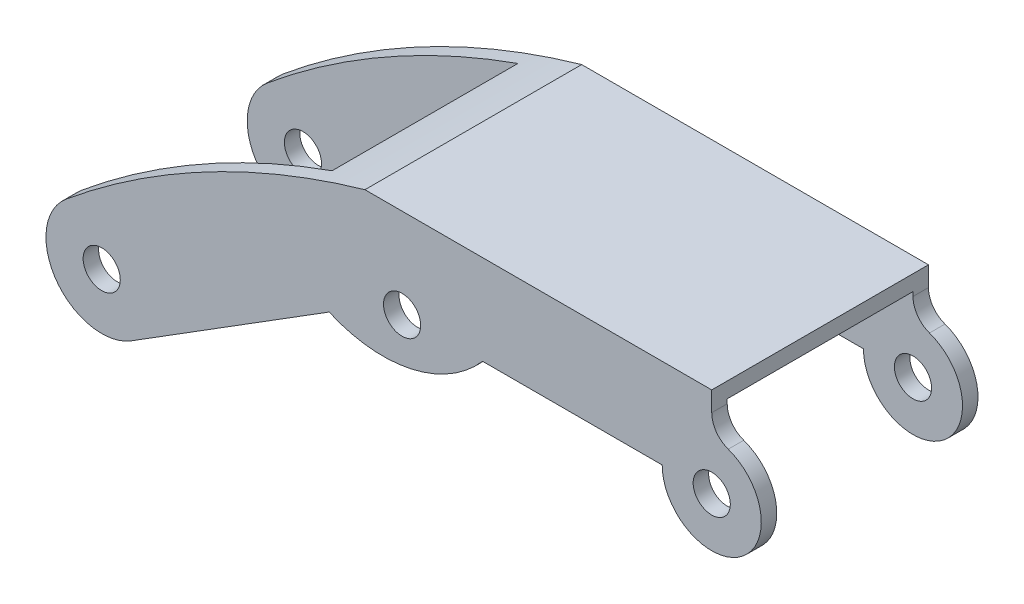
ISO-10303-21;
HEADER;
FILE_DESCRIPTION(('STEP AP214'),'2;1');
FILE_NAME('part.step','',(''),(''),'','','');
FILE_SCHEMA(('AUTOMOTIVE_DESIGN { 1 0 10303 214 1 1 1 1 }'));
ENDSEC;
DATA;
#1=APPLICATION_CONTEXT('core data for automotive mechanical design processes');
#2=APPLICATION_PROTOCOL_DEFINITION('international standard','automotive_design',2000,#1);
#3=PRODUCT_CONTEXT('',#1,'mechanical');
#4=PRODUCT('Part','Part','',(#3));
#5=PRODUCT_RELATED_PRODUCT_CATEGORY('part','',(#4));
#6=PRODUCT_DEFINITION_FORMATION('','',#4);
#7=PRODUCT_DEFINITION_CONTEXT('part definition',#1,'design');
#8=PRODUCT_DEFINITION('design','',#6,#7);
#9=PRODUCT_DEFINITION_SHAPE('','',#8);
#10=(LENGTH_UNIT() NAMED_UNIT(*) SI_UNIT(.MILLI.,.METRE.));
#11=(NAMED_UNIT(*) PLANE_ANGLE_UNIT() SI_UNIT($,.RADIAN.));
#12=(NAMED_UNIT(*) SI_UNIT($,.STERADIAN.) SOLID_ANGLE_UNIT());
#13=UNCERTAINTY_MEASURE_WITH_UNIT(LENGTH_MEASURE(1.E-05),#10,'distance_accuracy_value','');
#14=(GEOMETRIC_REPRESENTATION_CONTEXT(3) GLOBAL_UNCERTAINTY_ASSIGNED_CONTEXT((#13)) GLOBAL_UNIT_ASSIGNED_CONTEXT((#10,
#11,#12)) REPRESENTATION_CONTEXT('',''));
#15=CARTESIAN_POINT('',(0.,0.,0.));
#16=DIRECTION('',(0.,0.,1.));
#17=DIRECTION('',(1.,0.,0.));
#18=AXIS2_PLACEMENT_3D('',#15,#16,#17);
#19=CARTESIAN_POINT('',(-49.255622,-8.93796964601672,0.));
#20=DIRECTION('',(0.,0.,1.));
#21=DIRECTION('',(1.,0.,0.));
#22=AXIS2_PLACEMENT_3D('',#19,#20,#21);
#23=CYLINDRICAL_SURFACE('',#22,4.5);
#24=CARTESIAN_POINT('',(-49.255622,-8.93796964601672,-8.75));
#25=DIRECTION('',(0.,0.,1.));
#26=DIRECTION('',(1.,0.,0.));
#27=AXIS2_PLACEMENT_3D('',#24,#25,#26);
#28=CIRCLE('',#27,4.5);
#29=CARTESIAN_POINT('',(-52.1243606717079,-5.47093367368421,-8.75));
#30=VERTEX_POINT('',#29);
#31=CARTESIAN_POINT('',(-46.8679108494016,-12.7522632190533,-8.75));
#32=VERTEX_POINT('',#31);
#33=EDGE_CURVE('E179',#30,#32,#28,.T.);
#34=ORIENTED_EDGE('',*,*,#33,.T.);
#35=DIRECTION('',(0.,0.,1.));
#36=VECTOR('',#35,1.);
#37=CARTESIAN_POINT('',(-46.8679108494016,-12.7522632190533,0.));
#38=LINE('',#37,#36);
#39=CARTESIAN_POINT('',(-46.8679108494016,-12.7522632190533,-7.5));
#40=VERTEX_POINT('',#39);
#41=EDGE_CURVE('E264',#40,#32,#38,.F.);
#42=ORIENTED_EDGE('',*,*,#41,.F.);
#43=CARTESIAN_POINT('',(-49.255622,-8.93796964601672,-7.5));
#44=DIRECTION('',(0.,0.,1.));
#45=DIRECTION('',(1.,0.,0.));
#46=AXIS2_PLACEMENT_3D('',#43,#44,#45);
#47=CIRCLE('',#46,4.5);
#48=CARTESIAN_POINT('',(-52.1243606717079,-5.47093367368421,-7.49999999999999));
#49=VERTEX_POINT('',#48);
#50=EDGE_CURVE('E166',#40,#49,#47,.F.);
#51=ORIENTED_EDGE('',*,*,#50,.T.);
#52=DIRECTION('',(0.,0.,1.));
#53=VECTOR('',#52,1.);
#54=CARTESIAN_POINT('',(-52.1243606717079,-5.47093367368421,0.));
#55=LINE('',#54,#53);
#56=EDGE_CURVE('E262',#49,#30,#55,.F.);
#57=ORIENTED_EDGE('',*,*,#56,.T.);
#58=EDGE_LOOP('',(#34,#42,#51,#57));
#59=FACE_BOUND('',#58,.T.);
#60=ADVANCED_FACE('F16',(#59),#23,.T.);
#61=CARTESIAN_POINT('',(-30.8896094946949,-2.75000000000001,0.));
#62=DIRECTION('',(0.530602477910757,-0.847620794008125,0.));
#63=DIRECTION('',(0.847620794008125,0.530602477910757,0.));
#64=AXIS2_PLACEMENT_3D('',#61,#62,#63);
#65=PLANE('',#64);
#66=DIRECTION('',(0.847620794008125,0.530602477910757,0.));
#67=VECTOR('',#66,1.);
#68=CARTESIAN_POINT('',(-46.8679108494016,-12.7522632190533,-8.75));
#69=LINE('',#68,#67);
#70=CARTESIAN_POINT('',(-30.8896094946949,-2.75,-8.75));
#71=VERTEX_POINT('',#70);
#72=EDGE_CURVE('E181',#32,#71,#69,.T.);
#73=ORIENTED_EDGE('',*,*,#72,.T.);
#74=DIRECTION('',(0.,0.,1.));
#75=VECTOR('',#74,1.);
#76=CARTESIAN_POINT('',(-30.8896094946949,-2.75,0.));
#77=LINE('',#76,#75);
#78=CARTESIAN_POINT('',(-30.8896094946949,-2.75000000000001,-7.50000000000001));
#79=VERTEX_POINT('',#78);
#80=EDGE_CURVE('E267',#79,#71,#77,.F.);
#81=ORIENTED_EDGE('',*,*,#80,.F.);
#82=DIRECTION('',(-0.847620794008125,-0.530602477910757,0.));
#83=VECTOR('',#82,1.);
#84=CARTESIAN_POINT('',(-30.8896094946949,-2.75000000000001,-7.50000000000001));
#85=LINE('',#84,#83);
#86=EDGE_CURVE('E165',#79,#40,#85,.T.);
#87=ORIENTED_EDGE('',*,*,#86,.T.);
#88=ORIENTED_EDGE('',*,*,#41,.T.);
#89=EDGE_LOOP('',(#73,#81,#87,#88));
#90=FACE_BOUND('',#89,.T.);
#91=ADVANCED_FACE('F356',(#90),#65,.T.);
#92=CARTESIAN_POINT('',(-26.5602993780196,7.02963635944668,0.));
#93=DIRECTION('',(0.,0.,1.));
#94=DIRECTION('',(1.,0.,0.));
#95=AXIS2_PLACEMENT_3D('',#92,#93,#94);
#96=CYLINDRICAL_SURFACE('',#95,10.6950555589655);
#97=CARTESIAN_POINT('',(-26.5602993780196,7.02963635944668,-8.75));
#98=DIRECTION('',(0.,0.,1.));
#99=DIRECTION('',(1.,0.,0.));
#100=AXIS2_PLACEMENT_3D('',#97,#98,#99);
#101=CIRCLE('',#100,10.6950555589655);
#102=CARTESIAN_POINT('',(-18.5,0.,-8.75));
#103=VERTEX_POINT('',#102);
#104=EDGE_CURVE('E183',#71,#103,#101,.T.);
#105=ORIENTED_EDGE('',*,*,#104,.T.);
#106=DIRECTION('',(0.,0.,-1.));
#107=VECTOR('',#106,1.);
#108=CARTESIAN_POINT('',(-18.5,0.,0.));
#109=LINE('',#108,#107);
#110=CARTESIAN_POINT('',(-18.5,0.,-7.50000000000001));
#111=VERTEX_POINT('',#110);
#112=EDGE_CURVE('E270',#111,#103,#109,.T.);
#113=ORIENTED_EDGE('',*,*,#112,.F.);
#114=CARTESIAN_POINT('',(-26.5602993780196,7.02963635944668,-7.5));
#115=DIRECTION('',(0.,0.,1.));
#116=DIRECTION('',(1.,0.,0.));
#117=AXIS2_PLACEMENT_3D('',#114,#115,#116);
#118=CIRCLE('',#117,10.6950555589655);
#119=EDGE_CURVE('E160',#111,#79,#118,.F.);
#120=ORIENTED_EDGE('',*,*,#119,.T.);
#121=ORIENTED_EDGE('',*,*,#80,.T.);
#122=EDGE_LOOP('',(#105,#113,#120,#121));
#123=FACE_BOUND('',#122,.T.);
#124=ADVANCED_FACE('F359',(#123),#96,.T.);
#125=CARTESIAN_POINT('',(-4.,0.,0.));
#126=DIRECTION('',(0.,-1.,0.));
#127=DIRECTION('',(0.,0.,-1.));
#128=AXIS2_PLACEMENT_3D('',#125,#126,#127);
#129=PLANE('',#128);
#130=DIRECTION('',(1.,0.,0.));
#131=VECTOR('',#130,1.);
#132=CARTESIAN_POINT('',(-24.840965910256,0.,-8.75));
#133=LINE('',#132,#131);
#134=CARTESIAN_POINT('',(-4.,0.,-8.75));
#135=VERTEX_POINT('',#134);
#136=EDGE_CURVE('E185',#103,#135,#133,.T.);
#137=ORIENTED_EDGE('',*,*,#136,.T.);
#138=DIRECTION('',(0.,0.,1.));
#139=VECTOR('',#138,1.);
#140=CARTESIAN_POINT('',(-4.,0.,0.));
#141=LINE('',#140,#139);
#142=CARTESIAN_POINT('',(-4.,0.,-7.50000000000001));
#143=VERTEX_POINT('',#142);
#144=EDGE_CURVE('E148',#143,#135,#141,.F.);
#145=ORIENTED_EDGE('',*,*,#144,.F.);
#146=DIRECTION('',(-1.,0.,0.));
#147=VECTOR('',#146,1.);
#148=CARTESIAN_POINT('',(10.7039543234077,0.,-7.50000000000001));
#149=LINE('',#148,#147);
#150=EDGE_CURVE('E159',#143,#111,#149,.T.);
#151=ORIENTED_EDGE('',*,*,#150,.T.);
#152=ORIENTED_EDGE('',*,*,#112,.T.);
#153=EDGE_LOOP('',(#137,#145,#151,#152));
#154=FACE_BOUND('',#153,.T.);
#155=ADVANCED_FACE('F362',(#154),#129,.T.);
#156=CARTESIAN_POINT('',(0.,0.,0.));
#157=DIRECTION('',(0.,0.,1.));
#158=DIRECTION('',(1.,0.,0.));
#159=AXIS2_PLACEMENT_3D('',#156,#157,#158);
#160=CYLINDRICAL_SURFACE('',#159,4.);
#161=CARTESIAN_POINT('',(0.,0.,-8.75));
#162=DIRECTION('',(0.,0.,1.));
#163=DIRECTION('',(1.,0.,0.));
#164=AXIS2_PLACEMENT_3D('',#161,#162,#163);
#165=CIRCLE('',#164,4.);
#166=CARTESIAN_POINT('',(1.33333333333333,3.77123616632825,-8.75));
#167=VERTEX_POINT('',#166);
#168=EDGE_CURVE('E146',#135,#167,#165,.T.);
#169=ORIENTED_EDGE('',*,*,#168,.T.);
#170=DIRECTION('',(0.,0.,1.));
#171=VECTOR('',#170,1.);
#172=CARTESIAN_POINT('',(1.33333333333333,3.77123616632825,0.));
#173=LINE('',#172,#171);
#174=CARTESIAN_POINT('',(1.33333333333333,3.77123616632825,-7.50000000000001));
#175=VERTEX_POINT('',#174);
#176=EDGE_CURVE('E139',#167,#175,#173,.T.);
#177=ORIENTED_EDGE('',*,*,#176,.T.);
#178=CARTESIAN_POINT('',(0.,0.,-7.50000000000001));
#179=DIRECTION('',(0.,0.,1.));
#180=DIRECTION('',(1.,0.,0.));
#181=AXIS2_PLACEMENT_3D('',#178,#179,#180);
#182=CIRCLE('',#181,4.);
#183=EDGE_CURVE('E143',#175,#143,#182,.F.);
#184=ORIENTED_EDGE('',*,*,#183,.T.);
#185=ORIENTED_EDGE('',*,*,#144,.T.);
#186=EDGE_LOOP('',(#169,#177,#184,#185));
#187=FACE_BOUND('',#186,.T.);
#188=ADVANCED_FACE('F140',(#187),#160,.T.);
#189=CARTESIAN_POINT('',(2.,5.65685424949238,0.));
#190=DIRECTION('',(0.,0.,1.));
#191=DIRECTION('',(1.,0.,0.));
#192=AXIS2_PLACEMENT_3D('',#189,#190,#191);
#193=CYLINDRICAL_SURFACE('',#192,2.);
#194=ORIENTED_EDGE('',*,*,#176,.F.);
#195=CARTESIAN_POINT('',(2.,5.65685424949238,-8.75));
#196=DIRECTION('',(0.,0.,1.));
#197=DIRECTION('',(1.,0.,0.));
#198=AXIS2_PLACEMENT_3D('',#195,#196,#197);
#199=CIRCLE('',#198,2.);
#200=CARTESIAN_POINT('',(0.,5.65685424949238,-8.75));
#201=VERTEX_POINT('',#200);
#202=EDGE_CURVE('E187',#167,#201,#199,.F.);
#203=ORIENTED_EDGE('',*,*,#202,.T.);
#204=DIRECTION('',(0.,0.,-1.));
#205=VECTOR('',#204,1.);
#206=CARTESIAN_POINT('',(0.,5.65685424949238,0.));
#207=LINE('',#206,#205);
#208=CARTESIAN_POINT('',(0.,5.65685424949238,-7.50000000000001));
#209=VERTEX_POINT('',#208);
#210=EDGE_CURVE('E133',#209,#201,#207,.T.);
#211=ORIENTED_EDGE('',*,*,#210,.F.);
#212=CARTESIAN_POINT('',(2.,5.65685424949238,-7.50000000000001));
#213=DIRECTION('',(0.,0.,1.));
#214=DIRECTION('',(1.,0.,0.));
#215=AXIS2_PLACEMENT_3D('',#212,#213,#214);
#216=CIRCLE('',#215,2.);
#217=EDGE_CURVE('E19',#209,#175,#216,.T.);
#218=ORIENTED_EDGE('',*,*,#217,.T.);
#219=EDGE_LOOP('',(#194,#203,#211,#218));
#220=FACE_BOUND('',#219,.T.);
#221=ADVANCED_FACE('F151',(#220),#193,.F.);
#222=CARTESIAN_POINT('',(-25.,0.,0.));
#223=DIRECTION('',(0.,0.,1.));
#224=DIRECTION('',(1.,0.,0.));
#225=AXIS2_PLACEMENT_3D('',#222,#223,#224);
#226=CYLINDRICAL_SURFACE('',#225,1.5);
#227=CARTESIAN_POINT('',(-25.,0.,-8.75));
#228=DIRECTION('',(0.,0.,1.));
#229=DIRECTION('',(1.,0.,0.));
#230=AXIS2_PLACEMENT_3D('',#227,#228,#229);
#231=CIRCLE('',#230,1.5);
#232=CARTESIAN_POINT('',(-23.5,0.,-8.75));
#233=VERTEX_POINT('',#232);
#234=EDGE_CURVE('E190',#233,#233,#231,.F.);
#235=ORIENTED_EDGE('',*,*,#234,.T.);
#236=EDGE_LOOP('',(#235));
#237=FACE_BOUND('',#236,.T.);
#238=CARTESIAN_POINT('',(-25.,0.,-7.50000000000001));
#239=DIRECTION('',(0.,0.,1.));
#240=DIRECTION('',(1.,0.,0.));
#241=AXIS2_PLACEMENT_3D('',#238,#239,#240);
#242=CIRCLE('',#241,1.5);
#243=CARTESIAN_POINT('',(-23.5,0.,-7.50000000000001));
#244=VERTEX_POINT('',#243);
#245=EDGE_CURVE('E169',#244,#244,#242,.T.);
#246=ORIENTED_EDGE('',*,*,#245,.T.);
#247=EDGE_LOOP('',(#246));
#248=FACE_BOUND('',#247,.T.);
#249=ADVANCED_FACE('F443',(#237,#248),#226,.F.);
#250=CARTESIAN_POINT('',(-49.255622,-8.93796964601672,0.));
#251=DIRECTION('',(0.,0.,1.));
#252=DIRECTION('',(1.,0.,0.));
#253=AXIS2_PLACEMENT_3D('',#250,#251,#252);
#254=CYLINDRICAL_SURFACE('',#253,1.5);
#255=CARTESIAN_POINT('',(-49.255622,-8.93796964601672,-8.75));
#256=DIRECTION('',(0.,0.,1.));
#257=DIRECTION('',(1.,0.,0.));
#258=AXIS2_PLACEMENT_3D('',#255,#256,#257);
#259=CIRCLE('',#258,1.5);
#260=CARTESIAN_POINT('',(-47.755622,-8.93796964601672,-8.75));
#261=VERTEX_POINT('',#260);
#262=EDGE_CURVE('E193',#261,#261,#259,.F.);
#263=ORIENTED_EDGE('',*,*,#262,.T.);
#264=EDGE_LOOP('',(#263));
#265=FACE_BOUND('',#264,.T.);
#266=CARTESIAN_POINT('',(-49.255622,-8.93796964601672,-7.50000000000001));
#267=DIRECTION('',(0.,0.,1.));
#268=DIRECTION('',(1.,0.,0.));
#269=AXIS2_PLACEMENT_3D('',#266,#267,#268);
#270=CIRCLE('',#269,1.5);
#271=CARTESIAN_POINT('',(-47.755622,-8.93796964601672,-7.50000000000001));
#272=VERTEX_POINT('',#271);
#273=EDGE_CURVE('E172',#272,#272,#270,.T.);
#274=ORIENTED_EDGE('',*,*,#273,.T.);
#275=EDGE_LOOP('',(#274));
#276=FACE_BOUND('',#275,.T.);
#277=ADVANCED_FACE('F439',(#265,#276),#254,.F.);
#278=CARTESIAN_POINT('',(0.,0.,0.));
#279=DIRECTION('',(0.,0.,1.));
#280=DIRECTION('',(1.,0.,0.));
#281=AXIS2_PLACEMENT_3D('',#278,#279,#280);
#282=CYLINDRICAL_SURFACE('',#281,1.5);
#283=CARTESIAN_POINT('',(0.,0.,-8.75));
#284=DIRECTION('',(0.,0.,1.));
#285=DIRECTION('',(1.,0.,0.));
#286=AXIS2_PLACEMENT_3D('',#283,#284,#285);
#287=CIRCLE('',#286,1.5);
#288=CARTESIAN_POINT('',(1.5,0.,-8.75));
#289=VERTEX_POINT('',#288);
#290=EDGE_CURVE('E196',#289,#289,#287,.F.);
#291=ORIENTED_EDGE('',*,*,#290,.T.);
#292=EDGE_LOOP('',(#291));
#293=FACE_BOUND('',#292,.T.);
#294=CARTESIAN_POINT('',(0.,0.,-7.50000000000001));
#295=DIRECTION('',(0.,0.,1.));
#296=DIRECTION('',(1.,0.,0.));
#297=AXIS2_PLACEMENT_3D('',#294,#295,#296);
#298=CIRCLE('',#297,1.5);
#299=CARTESIAN_POINT('',(1.5,0.,-7.50000000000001));
#300=VERTEX_POINT('',#299);
#301=EDGE_CURVE('E175',#300,#300,#298,.T.);
#302=ORIENTED_EDGE('',*,*,#301,.T.);
#303=EDGE_LOOP('',(#302));
#304=FACE_BOUND('',#303,.T.);
#305=ADVANCED_FACE('F436',(#293,#304),#282,.F.);
#306=CARTESIAN_POINT('',(0.,7.25,0.));
#307=DIRECTION('',(1.,0.,0.));
#308=DIRECTION('',(0.,0.,-1.));
#309=AXIS2_PLACEMENT_3D('',#306,#307,#308);
#310=PLANE('',#309);
#311=DIRECTION('',(0.,1.,0.));
#312=VECTOR('',#311,1.);
#313=CARTESIAN_POINT('',(0.,5.99999999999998,7.50000000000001));
#314=LINE('',#313,#312);
#315=CARTESIAN_POINT('',(0.,5.65685424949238,7.5));
#316=VERTEX_POINT('',#315);
#317=CARTESIAN_POINT('',(0.,6.,7.50000000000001));
#318=VERTEX_POINT('',#317);
#319=EDGE_CURVE('E199',#316,#318,#314,.T.);
#320=ORIENTED_EDGE('',*,*,#319,.T.);
#321=DIRECTION('',(0.,0.,1.));
#322=VECTOR('',#321,1.);
#323=CARTESIAN_POINT('',(0.,5.99999999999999,0.));
#324=LINE('',#323,#322);
#325=CARTESIAN_POINT('',(0.,5.99999999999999,-7.50000000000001));
#326=VERTEX_POINT('',#325);
#327=EDGE_CURVE('E178',#318,#326,#324,.F.);
#328=ORIENTED_EDGE('',*,*,#327,.T.);
#329=DIRECTION('',(0.,1.,0.));
#330=VECTOR('',#329,1.);
#331=CARTESIAN_POINT('',(0.,6.,-7.50000000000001));
#332=LINE('',#331,#330);
#333=EDGE_CURVE('E154',#326,#209,#332,.F.);
#334=ORIENTED_EDGE('',*,*,#333,.T.);
#335=ORIENTED_EDGE('',*,*,#210,.T.);
#336=DIRECTION('',(0.,1.,0.));
#337=VECTOR('',#336,1.);
#338=CARTESIAN_POINT('',(0.,-0.512302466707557,-8.75));
#339=LINE('',#338,#337);
#340=CARTESIAN_POINT('',(0.,7.25,-8.75));
#341=VERTEX_POINT('',#340);
#342=EDGE_CURVE('E189',#201,#341,#339,.T.);
#343=ORIENTED_EDGE('',*,*,#342,.T.);
#344=DIRECTION('',(0.,0.,1.));
#345=VECTOR('',#344,1.);
#346=CARTESIAN_POINT('',(0.,7.24999999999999,0.));
#347=LINE('',#346,#345);
#348=CARTESIAN_POINT('',(0.,7.25,8.75));
#349=VERTEX_POINT('',#348);
#350=EDGE_CURVE('E202',#349,#341,#347,.F.);
#351=ORIENTED_EDGE('',*,*,#350,.F.);
#352=DIRECTION('',(0.,1.,0.));
#353=VECTOR('',#352,1.);
#354=CARTESIAN_POINT('',(0.,7.25,8.75));
#355=LINE('',#354,#353);
#356=CARTESIAN_POINT('',(0.,5.65685424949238,8.75));
#357=VERTEX_POINT('',#356);
#358=EDGE_CURVE('E275',#349,#357,#355,.F.);
#359=ORIENTED_EDGE('',*,*,#358,.T.);
#360=DIRECTION('',(0.,0.,1.));
#361=VECTOR('',#360,1.);
#362=CARTESIAN_POINT('',(0.,5.65685424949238,0.));
#363=LINE('',#362,#361);
#364=EDGE_CURVE('E203',#357,#316,#363,.F.);
#365=ORIENTED_EDGE('',*,*,#364,.T.);
#366=EDGE_LOOP('',(#320,#328,#334,#335,#343,#351,#359,#365));
#367=FACE_BOUND('',#366,.T.);
#368=ADVANCED_FACE('F350',(#367),#310,.T.);
#369=CARTESIAN_POINT('',(10.7039543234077,6.,-7.50000000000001));
#370=DIRECTION('',(0.,0.,-1.));
#371=DIRECTION('',(-1.,0.,0.));
#372=AXIS2_PLACEMENT_3D('',#369,#370,#371);
#373=PLANE('',#372);
#374=ORIENTED_EDGE('',*,*,#301,.F.);
#375=EDGE_LOOP('',(#374));
#376=FACE_BOUND('',#375,.T.);
#377=ORIENTED_EDGE('',*,*,#273,.F.);
#378=EDGE_LOOP('',(#377));
#379=FACE_BOUND('',#378,.T.);
#380=ORIENTED_EDGE('',*,*,#245,.F.);
#381=EDGE_LOOP('',(#380));
#382=FACE_BOUND('',#381,.T.);
#383=ORIENTED_EDGE('',*,*,#50,.F.);
#384=ORIENTED_EDGE('',*,*,#86,.F.);
#385=ORIENTED_EDGE('',*,*,#119,.F.);
#386=ORIENTED_EDGE('',*,*,#150,.F.);
#387=ORIENTED_EDGE('',*,*,#183,.F.);
#388=ORIENTED_EDGE('',*,*,#217,.F.);
#389=ORIENTED_EDGE('',*,*,#333,.F.);
#390=DIRECTION('',(1.,0.,0.));
#391=VECTOR('',#390,1.);
#392=CARTESIAN_POINT('',(-32.0569635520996,5.99999999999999,-7.50000000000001));
#393=LINE('',#392,#391);
#394=CARTESIAN_POINT('',(-31.9022971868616,5.99999999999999,-7.5));
#395=VERTEX_POINT('',#394);
#396=EDGE_CURVE('E182',#326,#395,#393,.F.);
#397=ORIENTED_EDGE('',*,*,#396,.T.);
#398=CARTESIAN_POINT('',(-9.62295025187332,-56.8363369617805,-7.49999999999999));
#399=DIRECTION('',(0.,0.,1.));
#400=DIRECTION('',(1.,0.,0.));
#401=AXIS2_PLACEMENT_3D('',#398,#399,#400);
#402=CIRCLE('',#401,66.6691423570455);
#403=EDGE_CURVE('E204',#49,#395,#402,.F.);
#404=ORIENTED_EDGE('',*,*,#403,.F.);
#405=EDGE_LOOP('',(#383,#384,#385,#386,#387,#388,#389,#397,#404));
#406=FACE_BOUND('',#405,.T.);
#407=ADVANCED_FACE('F156',(#376,#379,#382,#406),#373,.F.);
#408=CARTESIAN_POINT('',(-32.0569635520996,5.99999999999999,0.));
#409=DIRECTION('',(0.,1.,0.));
#410=DIRECTION('',(0.,0.,1.));
#411=AXIS2_PLACEMENT_3D('',#408,#409,#410);
#412=PLANE('',#411);
#413=ORIENTED_EDGE('',*,*,#396,.F.);
#414=ORIENTED_EDGE('',*,*,#327,.F.);
#415=DIRECTION('',(1.,0.,0.));
#416=VECTOR('',#415,1.);
#417=CARTESIAN_POINT('',(-74.8178814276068,6.,7.50000000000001));
#418=LINE('',#417,#416);
#419=CARTESIAN_POINT('',(-31.9022971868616,6.,7.5));
#420=VERTEX_POINT('',#419);
#421=EDGE_CURVE('E297',#318,#420,#418,.F.);
#422=ORIENTED_EDGE('',*,*,#421,.T.);
#423=DIRECTION('',(0.,0.,1.));
#424=VECTOR('',#423,1.);
#425=CARTESIAN_POINT('',(-31.9022971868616,6.00000000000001,0.));
#426=LINE('',#425,#424);
#427=EDGE_CURVE('E207',#395,#420,#426,.T.);
#428=ORIENTED_EDGE('',*,*,#427,.F.);
#429=EDGE_LOOP('',(#413,#414,#422,#428));
#430=FACE_BOUND('',#429,.T.);
#431=ADVANCED_FACE('F343',(#430),#412,.F.);
#432=CARTESIAN_POINT('',(-24.840965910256,-0.512302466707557,-8.75));
#433=DIRECTION('',(0.,0.,1.));
#434=DIRECTION('',(1.,0.,0.));
#435=AXIS2_PLACEMENT_3D('',#432,#433,#434);
#436=PLANE('',#435);
#437=ORIENTED_EDGE('',*,*,#290,.F.);
#438=EDGE_LOOP('',(#437));
#439=FACE_BOUND('',#438,.T.);
#440=ORIENTED_EDGE('',*,*,#262,.F.);
#441=EDGE_LOOP('',(#440));
#442=FACE_BOUND('',#441,.T.);
#443=ORIENTED_EDGE('',*,*,#234,.F.);
#444=EDGE_LOOP('',(#443));
#445=FACE_BOUND('',#444,.T.);
#446=ORIENTED_EDGE('',*,*,#342,.F.);
#447=ORIENTED_EDGE('',*,*,#202,.F.);
#448=ORIENTED_EDGE('',*,*,#168,.F.);
#449=ORIENTED_EDGE('',*,*,#136,.F.);
#450=ORIENTED_EDGE('',*,*,#104,.F.);
#451=ORIENTED_EDGE('',*,*,#72,.F.);
#452=ORIENTED_EDGE('',*,*,#33,.F.);
#453=CARTESIAN_POINT('',(-9.62295025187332,-56.8363369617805,-8.75));
#454=DIRECTION('',(0.,0.,1.));
#455=DIRECTION('',(1.,0.,0.));
#456=AXIS2_PLACEMENT_3D('',#453,#454,#455);
#457=CIRCLE('',#456,66.6691423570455);
#458=CARTESIAN_POINT('',(-28.,7.24999999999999,-8.75));
#459=VERTEX_POINT('',#458);
#460=EDGE_CURVE('E213',#459,#30,#457,.T.);
#461=ORIENTED_EDGE('',*,*,#460,.F.);
#462=DIRECTION('',(1.,0.,0.));
#463=VECTOR('',#462,1.);
#464=CARTESIAN_POINT('',(-28.,7.24999999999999,-8.75));
#465=LINE('',#464,#463);
#466=EDGE_CURVE('E208',#341,#459,#465,.F.);
#467=ORIENTED_EDGE('',*,*,#466,.F.);
#468=EDGE_LOOP('',(#446,#447,#448,#449,#450,#451,#452,#461,#467));
#469=FACE_BOUND('',#468,.T.);
#470=ADVANCED_FACE('F365',(#439,#442,#445,#469),#436,.F.);
#471=CARTESIAN_POINT('',(-74.8178814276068,5.99999999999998,7.50000000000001));
#472=DIRECTION('',(0.,0.,1.));
#473=DIRECTION('',(1.,0.,0.));
#474=AXIS2_PLACEMENT_3D('',#471,#472,#473);
#475=PLANE('',#474);
#476=CARTESIAN_POINT('',(-25.,0.,7.50000000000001));
#477=DIRECTION('',(0.,0.,1.));
#478=DIRECTION('',(1.,0.,0.));
#479=AXIS2_PLACEMENT_3D('',#476,#477,#478);
#480=CIRCLE('',#479,1.5);
#481=CARTESIAN_POINT('',(-23.5,0.,7.50000000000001));
#482=VERTEX_POINT('',#481);
#483=EDGE_CURVE('E230',#482,#482,#480,.T.);
#484=ORIENTED_EDGE('',*,*,#483,.T.);
#485=EDGE_LOOP('',(#484));
#486=FACE_BOUND('',#485,.T.);
#487=CARTESIAN_POINT('',(-49.255622,-8.93796964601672,7.50000000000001));
#488=DIRECTION('',(0.,0.,1.));
#489=DIRECTION('',(1.,0.,0.));
#490=AXIS2_PLACEMENT_3D('',#487,#488,#489);
#491=CIRCLE('',#490,1.5);
#492=CARTESIAN_POINT('',(-47.755622,-8.93796964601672,7.50000000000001));
#493=VERTEX_POINT('',#492);
#494=EDGE_CURVE('E233',#493,#493,#491,.T.);
#495=ORIENTED_EDGE('',*,*,#494,.T.);
#496=EDGE_LOOP('',(#495));
#497=FACE_BOUND('',#496,.T.);
#498=CARTESIAN_POINT('',(0.,0.,7.50000000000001));
#499=DIRECTION('',(0.,0.,1.));
#500=DIRECTION('',(1.,0.,0.));
#501=AXIS2_PLACEMENT_3D('',#498,#499,#500);
#502=CIRCLE('',#501,1.5);
#503=CARTESIAN_POINT('',(1.5,0.,7.50000000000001));
#504=VERTEX_POINT('',#503);
#505=EDGE_CURVE('E236',#504,#504,#502,.T.);
#506=ORIENTED_EDGE('',*,*,#505,.T.);
#507=EDGE_LOOP('',(#506));
#508=FACE_BOUND('',#507,.T.);
#509=ORIENTED_EDGE('',*,*,#421,.F.);
#510=ORIENTED_EDGE('',*,*,#319,.F.);
#511=CARTESIAN_POINT('',(2.,5.65685424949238,7.5));
#512=DIRECTION('',(0.,0.,1.));
#513=DIRECTION('',(1.,0.,0.));
#514=AXIS2_PLACEMENT_3D('',#511,#512,#513);
#515=CIRCLE('',#514,2.);
#516=CARTESIAN_POINT('',(1.33333333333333,3.77123616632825,7.5));
#517=VERTEX_POINT('',#516);
#518=EDGE_CURVE('E200',#316,#517,#515,.T.);
#519=ORIENTED_EDGE('',*,*,#518,.T.);
#520=CARTESIAN_POINT('',(0.,0.,7.5));
#521=DIRECTION('',(0.,0.,1.));
#522=DIRECTION('',(1.,0.,0.));
#523=AXIS2_PLACEMENT_3D('',#520,#521,#522);
#524=CIRCLE('',#523,4.);
#525=CARTESIAN_POINT('',(-4.,0.,7.5));
#526=VERTEX_POINT('',#525);
#527=EDGE_CURVE('E225',#526,#517,#524,.T.);
#528=ORIENTED_EDGE('',*,*,#527,.F.);
#529=DIRECTION('',(1.,0.,0.));
#530=VECTOR('',#529,1.);
#531=CARTESIAN_POINT('',(-4.,0.,7.5));
#532=LINE('',#531,#530);
#533=CARTESIAN_POINT('',(-18.5,0.,7.5));
#534=VERTEX_POINT('',#533);
#535=EDGE_CURVE('E293',#534,#526,#532,.T.);
#536=ORIENTED_EDGE('',*,*,#535,.F.);
#537=CARTESIAN_POINT('',(-26.5602993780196,7.02963635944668,7.5));
#538=DIRECTION('',(0.,0.,1.));
#539=DIRECTION('',(1.,0.,0.));
#540=AXIS2_PLACEMENT_3D('',#537,#538,#539);
#541=CIRCLE('',#540,10.6950555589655);
#542=CARTESIAN_POINT('',(-30.8896094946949,-2.75000000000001,7.5));
#543=VERTEX_POINT('',#542);
#544=EDGE_CURVE('E220',#543,#534,#541,.T.);
#545=ORIENTED_EDGE('',*,*,#544,.F.);
#546=DIRECTION('',(0.847620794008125,0.530602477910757,0.));
#547=VECTOR('',#546,1.);
#548=CARTESIAN_POINT('',(-30.8896094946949,-2.75000000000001,7.5));
#549=LINE('',#548,#547);
#550=CARTESIAN_POINT('',(-46.8679108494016,-12.7522632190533,7.5));
#551=VERTEX_POINT('',#550);
#552=EDGE_CURVE('E290',#551,#543,#549,.T.);
#553=ORIENTED_EDGE('',*,*,#552,.F.);
#554=CARTESIAN_POINT('',(-49.255622,-8.93796964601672,7.5));
#555=DIRECTION('',(0.,0.,1.));
#556=DIRECTION('',(1.,0.,0.));
#557=AXIS2_PLACEMENT_3D('',#554,#555,#556);
#558=CIRCLE('',#557,4.5);
#559=CARTESIAN_POINT('',(-52.1243606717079,-5.47093367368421,7.5));
#560=VERTEX_POINT('',#559);
#561=EDGE_CURVE('E216',#560,#551,#558,.T.);
#562=ORIENTED_EDGE('',*,*,#561,.F.);
#563=CARTESIAN_POINT('',(-9.62295025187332,-56.8363369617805,7.5));
#564=DIRECTION('',(0.,0.,1.));
#565=DIRECTION('',(1.,0.,0.));
#566=AXIS2_PLACEMENT_3D('',#563,#564,#565);
#567=CIRCLE('',#566,66.6691423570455);
#568=EDGE_CURVE('E209',#420,#560,#567,.T.);
#569=ORIENTED_EDGE('',*,*,#568,.F.);
#570=EDGE_LOOP('',(#509,#510,#519,#528,#536,#545,#553,#562,#569));
#571=FACE_BOUND('',#570,.T.);
#572=ADVANCED_FACE('F328',(#486,#497,#508,#571),#475,.F.);
#573=CARTESIAN_POINT('',(2.,5.65685424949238,0.));
#574=DIRECTION('',(0.,0.,1.));
#575=DIRECTION('',(1.,0.,0.));
#576=AXIS2_PLACEMENT_3D('',#573,#574,#575);
#577=CYLINDRICAL_SURFACE('',#576,2.);
#578=ORIENTED_EDGE('',*,*,#364,.F.);
#579=CARTESIAN_POINT('',(2.,5.65685424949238,8.75));
#580=DIRECTION('',(0.,0.,1.));
#581=DIRECTION('',(1.,0.,0.));
#582=AXIS2_PLACEMENT_3D('',#579,#580,#581);
#583=CIRCLE('',#582,2.);
#584=CARTESIAN_POINT('',(1.33333333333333,3.77123616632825,8.75));
#585=VERTEX_POINT('',#584);
#586=EDGE_CURVE('E239',#585,#357,#583,.F.);
#587=ORIENTED_EDGE('',*,*,#586,.F.);
#588=DIRECTION('',(0.,0.,1.));
#589=VECTOR('',#588,1.);
#590=CARTESIAN_POINT('',(1.33333333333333,3.77123616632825,0.));
#591=LINE('',#590,#589);
#592=EDGE_CURVE('E228',#517,#585,#591,.T.);
#593=ORIENTED_EDGE('',*,*,#592,.F.);
#594=ORIENTED_EDGE('',*,*,#518,.F.);
#595=EDGE_LOOP('',(#578,#587,#593,#594));
#596=FACE_BOUND('',#595,.T.);
#597=ADVANCED_FACE('F375',(#596),#577,.F.);
#598=CARTESIAN_POINT('',(-28.,7.24999999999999,0.));
#599=DIRECTION('',(0.,1.,0.));
#600=DIRECTION('',(0.,0.,1.));
#601=AXIS2_PLACEMENT_3D('',#598,#599,#600);
#602=PLANE('',#601);
#603=ORIENTED_EDGE('',*,*,#466,.T.);
#604=DIRECTION('',(0.,0.,1.));
#605=VECTOR('',#604,1.);
#606=CARTESIAN_POINT('',(-28.,7.24999999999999,0.));
#607=LINE('',#606,#605);
#608=CARTESIAN_POINT('',(-28.,7.25,8.75));
#609=VERTEX_POINT('',#608);
#610=EDGE_CURVE('E212',#609,#459,#607,.F.);
#611=ORIENTED_EDGE('',*,*,#610,.F.);
#612=DIRECTION('',(1.,0.,0.));
#613=VECTOR('',#612,1.);
#614=CARTESIAN_POINT('',(-24.840965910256,7.25,8.75));
#615=LINE('',#614,#613);
#616=EDGE_CURVE('E242',#349,#609,#615,.F.);
#617=ORIENTED_EDGE('',*,*,#616,.F.);
#618=ORIENTED_EDGE('',*,*,#350,.T.);
#619=EDGE_LOOP('',(#603,#611,#617,#618));
#620=FACE_BOUND('',#619,.T.);
#621=ADVANCED_FACE('F371',(#620),#602,.T.);
#622=CARTESIAN_POINT('',(-9.62295025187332,-56.8363369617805,0.));
#623=DIRECTION('',(0.,0.,1.));
#624=DIRECTION('',(1.,0.,0.));
#625=AXIS2_PLACEMENT_3D('',#622,#623,#624);
#626=CYLINDRICAL_SURFACE('',#625,66.6691423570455);
#627=ORIENTED_EDGE('',*,*,#460,.T.);
#628=ORIENTED_EDGE('',*,*,#56,.F.);
#629=ORIENTED_EDGE('',*,*,#403,.T.);
#630=ORIENTED_EDGE('',*,*,#427,.T.);
#631=ORIENTED_EDGE('',*,*,#568,.T.);
#632=DIRECTION('',(0.,0.,1.));
#633=VECTOR('',#632,1.);
#634=CARTESIAN_POINT('',(-52.1243606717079,-5.47093367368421,0.));
#635=LINE('',#634,#633);
#636=CARTESIAN_POINT('',(-52.1243606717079,-5.47093367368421,8.75));
#637=VERTEX_POINT('',#636);
#638=EDGE_CURVE('E219',#637,#560,#635,.F.);
#639=ORIENTED_EDGE('',*,*,#638,.F.);
#640=CARTESIAN_POINT('',(-9.62295025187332,-56.8363369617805,8.75));
#641=DIRECTION('',(0.,0.,1.));
#642=DIRECTION('',(1.,0.,0.));
#643=AXIS2_PLACEMENT_3D('',#640,#641,#642);
#644=CIRCLE('',#643,66.6691423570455);
#645=EDGE_CURVE('E243',#609,#637,#644,.T.);
#646=ORIENTED_EDGE('',*,*,#645,.F.);
#647=ORIENTED_EDGE('',*,*,#610,.T.);
#648=EDGE_LOOP('',(#627,#628,#629,#630,#631,#639,#646,#647));
#649=FACE_BOUND('',#648,.T.);
#650=ADVANCED_FACE('F337',(#649),#626,.T.);
#651=CARTESIAN_POINT('',(-49.255622,-8.93796964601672,0.));
#652=DIRECTION('',(0.,0.,1.));
#653=DIRECTION('',(1.,0.,0.));
#654=AXIS2_PLACEMENT_3D('',#651,#652,#653);
#655=CYLINDRICAL_SURFACE('',#654,4.5);
#656=CARTESIAN_POINT('',(-49.255622,-8.93796964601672,8.75));
#657=DIRECTION('',(0.,0.,1.));
#658=DIRECTION('',(1.,0.,0.));
#659=AXIS2_PLACEMENT_3D('',#656,#657,#658);
#660=CIRCLE('',#659,4.5);
#661=CARTESIAN_POINT('',(-46.8679108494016,-12.7522632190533,8.75));
#662=VERTEX_POINT('',#661);
#663=EDGE_CURVE('E246',#637,#662,#660,.T.);
#664=ORIENTED_EDGE('',*,*,#663,.F.);
#665=ORIENTED_EDGE('',*,*,#638,.T.);
#666=ORIENTED_EDGE('',*,*,#561,.T.);
#667=DIRECTION('',(0.,0.,1.));
#668=VECTOR('',#667,1.);
#669=CARTESIAN_POINT('',(-46.8679108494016,-12.7522632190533,0.));
#670=LINE('',#669,#668);
#671=EDGE_CURVE('E224',#662,#551,#670,.F.);
#672=ORIENTED_EDGE('',*,*,#671,.F.);
#673=EDGE_LOOP('',(#664,#665,#666,#672));
#674=FACE_BOUND('',#673,.T.);
#675=ADVANCED_FACE('F334',(#674),#655,.T.);
#676=CARTESIAN_POINT('',(-30.8896094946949,-2.75000000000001,0.));
#677=DIRECTION('',(0.530602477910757,-0.847620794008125,0.));
#678=DIRECTION('',(0.847620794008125,0.530602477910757,0.));
#679=AXIS2_PLACEMENT_3D('',#676,#677,#678);
#680=PLANE('',#679);
#681=DIRECTION('',(0.847620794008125,0.530602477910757,0.));
#682=VECTOR('',#681,1.);
#683=CARTESIAN_POINT('',(-46.8679108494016,-12.7522632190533,8.75));
#684=LINE('',#683,#682);
#685=CARTESIAN_POINT('',(-30.8896094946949,-2.75,8.75));
#686=VERTEX_POINT('',#685);
#687=EDGE_CURVE('E249',#662,#686,#684,.T.);
#688=ORIENTED_EDGE('',*,*,#687,.F.);
#689=ORIENTED_EDGE('',*,*,#671,.T.);
#690=ORIENTED_EDGE('',*,*,#552,.T.);
#691=DIRECTION('',(0.,0.,1.));
#692=VECTOR('',#691,1.);
#693=CARTESIAN_POINT('',(-30.8896094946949,-2.75,0.));
#694=LINE('',#693,#692);
#695=EDGE_CURVE('E223',#686,#543,#694,.F.);
#696=ORIENTED_EDGE('',*,*,#695,.F.);
#697=EDGE_LOOP('',(#688,#689,#690,#696));
#698=FACE_BOUND('',#697,.T.);
#699=ADVANCED_FACE('F331',(#698),#680,.T.);
#700=CARTESIAN_POINT('',(-26.5602993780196,7.02963635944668,0.));
#701=DIRECTION('',(0.,0.,1.));
#702=DIRECTION('',(1.,0.,0.));
#703=AXIS2_PLACEMENT_3D('',#700,#701,#702);
#704=CYLINDRICAL_SURFACE('',#703,10.6950555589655);
#705=CARTESIAN_POINT('',(-26.5602993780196,7.02963635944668,8.75));
#706=DIRECTION('',(0.,0.,1.));
#707=DIRECTION('',(1.,0.,0.));
#708=AXIS2_PLACEMENT_3D('',#705,#706,#707);
#709=CIRCLE('',#708,10.6950555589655);
#710=CARTESIAN_POINT('',(-18.5,0.,8.75));
#711=VERTEX_POINT('',#710);
#712=EDGE_CURVE('E250',#686,#711,#709,.T.);
#713=ORIENTED_EDGE('',*,*,#712,.F.);
#714=ORIENTED_EDGE('',*,*,#695,.T.);
#715=ORIENTED_EDGE('',*,*,#544,.T.);
#716=DIRECTION('',(0.,0.,-1.));
#717=VECTOR('',#716,1.);
#718=CARTESIAN_POINT('',(-18.5,0.,0.));
#719=LINE('',#718,#717);
#720=EDGE_CURVE('E229',#711,#534,#719,.T.);
#721=ORIENTED_EDGE('',*,*,#720,.F.);
#722=EDGE_LOOP('',(#713,#714,#715,#721));
#723=FACE_BOUND('',#722,.T.);
#724=ADVANCED_FACE('F325',(#723),#704,.T.);
#725=CARTESIAN_POINT('',(-4.,0.,0.));
#726=DIRECTION('',(0.,-1.,0.));
#727=DIRECTION('',(0.,0.,-1.));
#728=AXIS2_PLACEMENT_3D('',#725,#726,#727);
#729=PLANE('',#728);
#730=DIRECTION('',(1.,0.,0.));
#731=VECTOR('',#730,1.);
#732=CARTESIAN_POINT('',(-24.840965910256,0.,8.75));
#733=LINE('',#732,#731);
#734=CARTESIAN_POINT('',(-4.,0.,8.75));
#735=VERTEX_POINT('',#734);
#736=EDGE_CURVE('E253',#711,#735,#733,.T.);
#737=ORIENTED_EDGE('',*,*,#736,.F.);
#738=ORIENTED_EDGE('',*,*,#720,.T.);
#739=ORIENTED_EDGE('',*,*,#535,.T.);
#740=DIRECTION('',(0.,0.,1.));
#741=VECTOR('',#740,1.);
#742=CARTESIAN_POINT('',(-4.,0.,0.));
#743=LINE('',#742,#741);
#744=EDGE_CURVE('E34',#735,#526,#743,.F.);
#745=ORIENTED_EDGE('',*,*,#744,.F.);
#746=EDGE_LOOP('',(#737,#738,#739,#745));
#747=FACE_BOUND('',#746,.T.);
#748=ADVANCED_FACE('F323',(#747),#729,.T.);
#749=CARTESIAN_POINT('',(0.,0.,0.));
#750=DIRECTION('',(0.,0.,1.));
#751=DIRECTION('',(1.,0.,0.));
#752=AXIS2_PLACEMENT_3D('',#749,#750,#751);
#753=CYLINDRICAL_SURFACE('',#752,4.);
#754=CARTESIAN_POINT('',(0.,0.,8.75));
#755=DIRECTION('',(0.,0.,1.));
#756=DIRECTION('',(1.,0.,0.));
#757=AXIS2_PLACEMENT_3D('',#754,#755,#756);
#758=CIRCLE('',#757,4.);
#759=EDGE_CURVE('E254',#735,#585,#758,.T.);
#760=ORIENTED_EDGE('',*,*,#759,.F.);
#761=ORIENTED_EDGE('',*,*,#744,.T.);
#762=ORIENTED_EDGE('',*,*,#527,.T.);
#763=ORIENTED_EDGE('',*,*,#592,.T.);
#764=EDGE_LOOP('',(#760,#761,#762,#763));
#765=FACE_BOUND('',#764,.T.);
#766=ADVANCED_FACE('F378',(#765),#753,.T.);
#767=CARTESIAN_POINT('',(-25.,0.,0.));
#768=DIRECTION('',(0.,0.,1.));
#769=DIRECTION('',(1.,0.,0.));
#770=AXIS2_PLACEMENT_3D('',#767,#768,#769);
#771=CYLINDRICAL_SURFACE('',#770,1.5);
#772=ORIENTED_EDGE('',*,*,#483,.F.);
#773=EDGE_LOOP('',(#772));
#774=FACE_BOUND('',#773,.T.);
#775=CARTESIAN_POINT('',(-25.,0.,8.75));
#776=DIRECTION('',(0.,0.,1.));
#777=DIRECTION('',(1.,0.,0.));
#778=AXIS2_PLACEMENT_3D('',#775,#776,#777);
#779=CIRCLE('',#778,1.5);
#780=CARTESIAN_POINT('',(-23.5,0.,8.75));
#781=VERTEX_POINT('',#780);
#782=EDGE_CURVE('E257',#781,#781,#779,.F.);
#783=ORIENTED_EDGE('',*,*,#782,.F.);
#784=EDGE_LOOP('',(#783));
#785=FACE_BOUND('',#784,.T.);
#786=ADVANCED_FACE('F380',(#774,#785),#771,.F.);
#787=CARTESIAN_POINT('',(-49.255622,-8.93796964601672,0.));
#788=DIRECTION('',(0.,0.,1.));
#789=DIRECTION('',(1.,0.,0.));
#790=AXIS2_PLACEMENT_3D('',#787,#788,#789);
#791=CYLINDRICAL_SURFACE('',#790,1.5);
#792=ORIENTED_EDGE('',*,*,#494,.F.);
#793=EDGE_LOOP('',(#792));
#794=FACE_BOUND('',#793,.T.);
#795=CARTESIAN_POINT('',(-49.255622,-8.93796964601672,8.75));
#796=DIRECTION('',(0.,0.,1.));
#797=DIRECTION('',(1.,0.,0.));
#798=AXIS2_PLACEMENT_3D('',#795,#796,#797);
#799=CIRCLE('',#798,1.5);
#800=CARTESIAN_POINT('',(-47.755622,-8.93796964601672,8.75));
#801=VERTEX_POINT('',#800);
#802=EDGE_CURVE('E25',#801,#801,#799,.F.);
#803=ORIENTED_EDGE('',*,*,#802,.F.);
#804=EDGE_LOOP('',(#803));
#805=FACE_BOUND('',#804,.T.);
#806=ADVANCED_FACE('F387',(#794,#805),#791,.F.);
#807=CARTESIAN_POINT('',(0.,0.,0.));
#808=DIRECTION('',(0.,0.,1.));
#809=DIRECTION('',(1.,0.,0.));
#810=AXIS2_PLACEMENT_3D('',#807,#808,#809);
#811=CYLINDRICAL_SURFACE('',#810,1.5);
#812=ORIENTED_EDGE('',*,*,#505,.F.);
#813=EDGE_LOOP('',(#812));
#814=FACE_BOUND('',#813,.T.);
#815=CARTESIAN_POINT('',(0.,0.,8.75));
#816=DIRECTION('',(0.,0.,1.));
#817=DIRECTION('',(1.,0.,0.));
#818=AXIS2_PLACEMENT_3D('',#815,#816,#817);
#819=CIRCLE('',#818,1.5);
#820=CARTESIAN_POINT('',(1.5,0.,8.75));
#821=VERTEX_POINT('',#820);
#822=EDGE_CURVE('E11',#821,#821,#819,.F.);
#823=ORIENTED_EDGE('',*,*,#822,.F.);
#824=EDGE_LOOP('',(#823));
#825=FACE_BOUND('',#824,.T.);
#826=ADVANCED_FACE('F392',(#814,#825),#811,.F.);
#827=CARTESIAN_POINT('',(-24.840965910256,-0.512302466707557,8.75));
#828=DIRECTION('',(0.,0.,1.));
#829=DIRECTION('',(1.,0.,0.));
#830=AXIS2_PLACEMENT_3D('',#827,#828,#829);
#831=PLANE('',#830);
#832=ORIENTED_EDGE('',*,*,#822,.T.);
#833=EDGE_LOOP('',(#832));
#834=FACE_BOUND('',#833,.T.);
#835=ORIENTED_EDGE('',*,*,#802,.T.);
#836=EDGE_LOOP('',(#835));
#837=FACE_BOUND('',#836,.T.);
#838=ORIENTED_EDGE('',*,*,#782,.T.);
#839=EDGE_LOOP('',(#838));
#840=FACE_BOUND('',#839,.T.);
#841=ORIENTED_EDGE('',*,*,#736,.T.);
#842=ORIENTED_EDGE('',*,*,#759,.T.);
#843=ORIENTED_EDGE('',*,*,#586,.T.);
#844=ORIENTED_EDGE('',*,*,#358,.F.);
#845=ORIENTED_EDGE('',*,*,#616,.T.);
#846=ORIENTED_EDGE('',*,*,#645,.T.);
#847=ORIENTED_EDGE('',*,*,#663,.T.);
#848=ORIENTED_EDGE('',*,*,#687,.T.);
#849=ORIENTED_EDGE('',*,*,#712,.T.);
#850=EDGE_LOOP('',(#841,#842,#843,#844,#845,#846,#847,#848,#849));
#851=FACE_BOUND('',#850,.T.);
#852=ADVANCED_FACE('F321',(#834,#837,#840,#851),#831,.T.);
#853=CLOSED_SHELL('',(#60,#91,#124,#155,#188,#221,#249,#277,#305,#368,#407,#431,#470,#572,#597,
#621,#650,#675,#699,#724,#748,#766,#786,#806,#826,#852));
#854=MANIFOLD_SOLID_BREP('B1',#853);
#855=ADVANCED_BREP_SHAPE_REPRESENTATION('',(#18,#854),#14);
#856=SHAPE_DEFINITION_REPRESENTATION(#9,#855);
ENDSEC;
END-ISO-10303-21;
